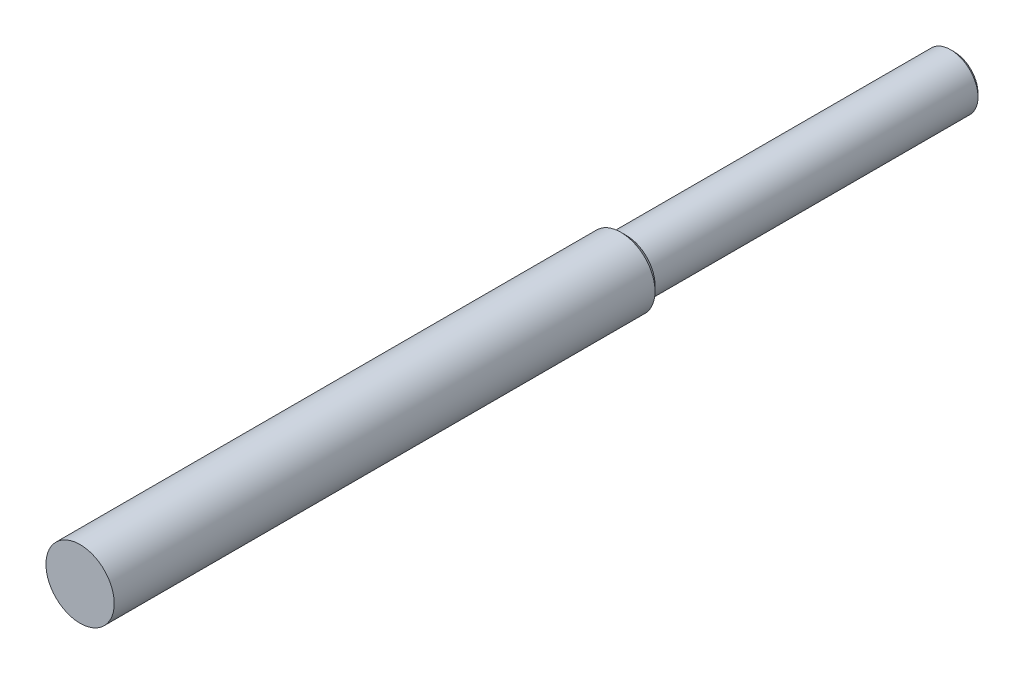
from build123d import *

# Parameters (mm, degrees)
ESQUISSE1_R      = 12.5
EXTRUSION1_DEPTH = 200
ESQUISSE2_R      = 10
EXTRUSION2_DEPTH = 120
CHANFREIN1_SIZE  = 1.25
CHANFREIN2_SIZE  = 2


with BuildPart() as part:
    # Esquisse1 → Extrusion1 (new body)
    with BuildSketch(Plane.XY):
        Circle(ESQUISSE1_R)
    extrude(amount=EXTRUSION1_DEPTH)

    # Esquisse2 → Extrusion2 (add)
    with BuildSketch(Plane(origin=(0, 0, 0), x_dir=(-1, 0, 0), z_dir=(0, 0, -1))):
        with Locations(Location((0, 0, 0), (0, 0, 180))):
            Circle(ESQUISSE2_R)
    extrude(amount=EXTRUSION2_DEPTH)

    # Chanfrein1
    chanfrein1_edges = [part.edges().sort_by_distance(p)[0] for p in [
        (-10, 0, -120),
    ]]
    chamfer(chanfrein1_edges, length=CHANFREIN1_SIZE)

    # Chanfrein2
    chanfrein2_edges = [part.edges().sort_by_distance(p)[0] for p in [
        (-12.5, 0, 0),
    ]]
    chamfer(chanfrein2_edges, length=CHANFREIN2_SIZE)


solid = part.part
